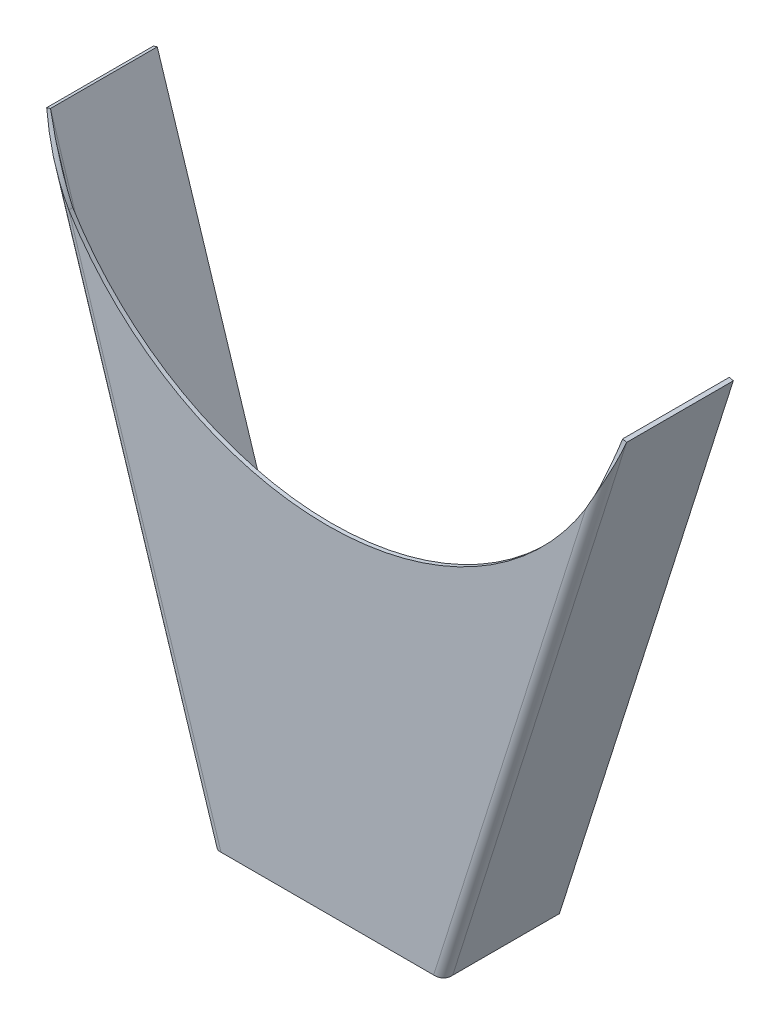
ISO-10303-21;
HEADER;
FILE_DESCRIPTION(('STEP AP214'),'2;1');
FILE_NAME('part.step','',(''),(''),'','','');
FILE_SCHEMA(('AUTOMOTIVE_DESIGN { 1 0 10303 214 1 1 1 1 }'));
ENDSEC;
DATA;
#1=APPLICATION_CONTEXT('core data for automotive mechanical design processes');
#2=APPLICATION_PROTOCOL_DEFINITION('international standard','automotive_design',2000,#1);
#3=PRODUCT_CONTEXT('',#1,'mechanical');
#4=PRODUCT('Part','Part','',(#3));
#5=PRODUCT_RELATED_PRODUCT_CATEGORY('part','',(#4));
#6=PRODUCT_DEFINITION_FORMATION('','',#4);
#7=PRODUCT_DEFINITION_CONTEXT('part definition',#1,'design');
#8=PRODUCT_DEFINITION('design','',#6,#7);
#9=PRODUCT_DEFINITION_SHAPE('','',#8);
#10=(LENGTH_UNIT() NAMED_UNIT(*) SI_UNIT(.MILLI.,.METRE.));
#11=(NAMED_UNIT(*) PLANE_ANGLE_UNIT() SI_UNIT($,.RADIAN.));
#12=(NAMED_UNIT(*) SI_UNIT($,.STERADIAN.) SOLID_ANGLE_UNIT());
#13=UNCERTAINTY_MEASURE_WITH_UNIT(LENGTH_MEASURE(1.E-05),#10,'distance_accuracy_value','');
#14=(GEOMETRIC_REPRESENTATION_CONTEXT(3) GLOBAL_UNCERTAINTY_ASSIGNED_CONTEXT((#13)) GLOBAL_UNIT_ASSIGNED_CONTEXT((#10,
#11,#12)) REPRESENTATION_CONTEXT('',''));
#15=CARTESIAN_POINT('',(0.,0.,0.));
#16=DIRECTION('',(0.,0.,1.));
#17=DIRECTION('',(1.,0.,0.));
#18=AXIS2_PLACEMENT_3D('',#15,#16,#17);
#19=CARTESIAN_POINT('',(0.,0.,2.5));
#20=DIRECTION('',(0.,0.,-1.));
#21=DIRECTION('',(-1.,0.,0.));
#22=AXIS2_PLACEMENT_3D('',#19,#20,#21);
#23=CYLINDRICAL_SURFACE('',#22,190.);
#24=CARTESIAN_POINT('',(0.,0.,2.5));
#25=DIRECTION('',(0.,0.,-1.));
#26=DIRECTION('',(1.,0.,0.));
#27=AXIS2_PLACEMENT_3D('',#24,#25,#26);
#28=CIRCLE('',#27,190.);
#29=CARTESIAN_POINT('',(161.506295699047,-100.078551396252,2.5));
#30=VERTEX_POINT('',#29);
#31=CARTESIAN_POINT('',(-161.506295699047,-100.078551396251,2.49999999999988));
#32=VERTEX_POINT('',#31);
#33=EDGE_CURVE('E13',#30,#32,#28,.T.);
#34=ORIENTED_EDGE('',*,*,#33,.F.);
#35=DIRECTION('',(0.,0.,1.));
#36=VECTOR('',#35,1.);
#37=CARTESIAN_POINT('',(161.506295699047,-100.07855139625,2.06014373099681E-13));
#38=LINE('',#37,#36);
#39=CARTESIAN_POINT('',(161.506295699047,-100.07855139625,2.06006392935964E-13));
#40=VERTEX_POINT('',#39);
#41=EDGE_CURVE('E221',#40,#30,#38,.T.);
#42=ORIENTED_EDGE('',*,*,#41,.F.);
#43=CARTESIAN_POINT('',(0.,0.,0.));
#44=DIRECTION('',(0.,0.,-1.));
#45=DIRECTION('',(-1.,0.,0.));
#46=AXIS2_PLACEMENT_3D('',#43,#44,#45);
#47=CIRCLE('',#46,190.);
#48=CARTESIAN_POINT('',(-161.506295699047,-100.078551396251,-1.16876994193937E-13));
#49=VERTEX_POINT('',#48);
#50=EDGE_CURVE('E79',#40,#49,#47,.T.);
#51=ORIENTED_EDGE('',*,*,#50,.T.);
#52=DIRECTION('',(0.,0.,1.));
#53=VECTOR('',#52,1.);
#54=CARTESIAN_POINT('',(-161.506295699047,-100.07855139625,-1.16993729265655E-13));
#55=LINE('',#54,#53);
#56=EDGE_CURVE('E361',#49,#32,#55,.T.);
#57=ORIENTED_EDGE('',*,*,#56,.T.);
#58=EDGE_LOOP('',(#34,#42,#51,#57));
#59=FACE_BOUND('',#58,.T.);
#60=ADVANCED_FACE('F76',(#59),#23,.F.);
#61=CARTESIAN_POINT('',(-72.4999999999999,-400.,2.5));
#62=DIRECTION('',(0.,-1.,0.));
#63=DIRECTION('',(1.,0.,0.));
#64=AXIS2_PLACEMENT_3D('',#61,#62,#63);
#65=PLANE('',#64);
#66=DIRECTION('',(1.,0.,0.));
#67=VECTOR('',#66,1.);
#68=CARTESIAN_POINT('',(0.,-400.,0.));
#69=LINE('',#68,#67);
#70=CARTESIAN_POINT('',(-66.4154647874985,-400.,-1.33949355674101E-13));
#71=VERTEX_POINT('',#70);
#72=CARTESIAN_POINT('',(66.4154647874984,-400.,2.23128807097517E-13));
#73=VERTEX_POINT('',#72);
#74=EDGE_CURVE('E355',#71,#73,#69,.T.);
#75=ORIENTED_EDGE('',*,*,#74,.T.);
#76=DIRECTION('',(0.,0.,1.));
#77=VECTOR('',#76,1.);
#78=CARTESIAN_POINT('',(66.4154647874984,-400.,2.2291196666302E-13));
#79=LINE('',#78,#77);
#80=CARTESIAN_POINT('',(66.4154647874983,-400.,2.50000000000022));
#81=VERTEX_POINT('',#80);
#82=EDGE_CURVE('E224',#73,#81,#79,.T.);
#83=ORIENTED_EDGE('',*,*,#82,.T.);
#84=DIRECTION('',(1.,0.,0.));
#85=VECTOR('',#84,1.);
#86=CARTESIAN_POINT('',(-72.4999999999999,-400.,2.5));
#87=LINE('',#86,#85);
#88=CARTESIAN_POINT('',(-66.4154647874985,-400.,2.5));
#89=VERTEX_POINT('',#88);
#90=EDGE_CURVE('E84',#89,#81,#87,.T.);
#91=ORIENTED_EDGE('',*,*,#90,.F.);
#92=DIRECTION('',(0.,0.,1.));
#93=VECTOR('',#92,1.);
#94=CARTESIAN_POINT('',(-66.4154647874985,-400.,-1.33891322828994E-13));
#95=LINE('',#94,#93);
#96=EDGE_CURVE('E357',#71,#89,#95,.T.);
#97=ORIENTED_EDGE('',*,*,#96,.F.);
#98=EDGE_LOOP('',(#75,#83,#91,#97));
#99=FACE_BOUND('',#98,.T.);
#100=ADVANCED_FACE('F417',(#99),#65,.T.);
#101=CARTESIAN_POINT('',(0.,0.,2.5));
#102=DIRECTION('',(0.,0.,1.));
#103=DIRECTION('',(1.,0.,0.));
#104=AXIS2_PLACEMENT_3D('',#101,#102,#103);
#105=PLANE('',#104);
#106=ORIENTED_EDGE('',*,*,#90,.T.);
#107=DIRECTION('',(-0.302225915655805,-0.953236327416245,0.));
#108=VECTOR('',#107,1.);
#109=CARTESIAN_POINT('',(66.4154647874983,-400.,2.50000000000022));
#110=LINE('',#109,#108);
#111=EDGE_CURVE('E170',#81,#30,#110,.F.);
#112=ORIENTED_EDGE('',*,*,#111,.T.);
#113=ORIENTED_EDGE('',*,*,#33,.T.);
#114=DIRECTION('',(-0.302225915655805,0.953236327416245,0.));
#115=VECTOR('',#114,1.);
#116=CARTESIAN_POINT('',(-175.586131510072,-55.6700136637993,2.49999999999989));
#117=LINE('',#116,#115);
#118=EDGE_CURVE('E321',#32,#89,#117,.F.);
#119=ORIENTED_EDGE('',*,*,#118,.T.);
#120=EDGE_LOOP('',(#106,#112,#113,#119));
#121=FACE_BOUND('',#120,.T.);
#122=ADVANCED_FACE('F338',(#121),#105,.T.);
#123=CARTESIAN_POINT('',(0.,0.,0.));
#124=DIRECTION('',(0.,0.,1.));
#125=DIRECTION('',(1.,0.,0.));
#126=AXIS2_PLACEMENT_3D('',#123,#124,#125);
#127=PLANE('',#126);
#128=DIRECTION('',(-0.302225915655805,-0.953236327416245,0.));
#129=VECTOR('',#128,1.);
#130=CARTESIAN_POINT('',(66.4154647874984,-400.,2.2291196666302E-13));
#131=LINE('',#130,#129);
#132=EDGE_CURVE('E218',#73,#40,#131,.F.);
#133=ORIENTED_EDGE('',*,*,#132,.F.);
#134=ORIENTED_EDGE('',*,*,#74,.F.);
#135=DIRECTION('',(-0.302225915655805,0.953236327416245,0.));
#136=VECTOR('',#135,1.);
#137=CARTESIAN_POINT('',(-175.586131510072,-55.6700136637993,-1.14491749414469E-13));
#138=LINE('',#137,#136);
#139=EDGE_CURVE('E353',#49,#71,#138,.F.);
#140=ORIENTED_EDGE('',*,*,#139,.F.);
#141=ORIENTED_EDGE('',*,*,#50,.F.);
#142=EDGE_LOOP('',(#133,#134,#140,#141));
#143=FACE_BOUND('',#142,.T.);
#144=ADVANCED_FACE('F414',(#143),#127,.F.);
#145=CARTESIAN_POINT('',(-66.4154647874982,-400.,2.52499999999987));
#146=CARTESIAN_POINT('',(-67.1887463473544,-400.084383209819,2.5249999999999));
#147=CARTESIAN_POINT('',(-67.9614739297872,-400.168646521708,2.37339084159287));
#148=CARTESIAN_POINT('',(-69.397115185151,-400.302300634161,1.78980571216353));
#149=CARTESIAN_POINT('',(-70.0593664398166,-400.351509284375,1.35805935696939));
#150=CARTESIAN_POINT('',(-71.1798921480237,-400.385255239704,0.279734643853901));
#151=CARTESIAN_POINT('',(-71.6377621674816,-400.369664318,-0.366419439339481));
#152=CARTESIAN_POINT('',(-72.2866841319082,-400.253887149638,-1.77531857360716));
#153=CARTESIAN_POINT('',(-72.4775091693,-400.153656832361,-2.53737713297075));
#154=CARTESIAN_POINT('',(-72.5238309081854,-400.007555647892,-3.29999999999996));
#155=CARTESIAN_POINT('',(-66.4154647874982,-400.,2.49999999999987));
#156=CARTESIAN_POINT('',(-67.1856262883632,-400.083394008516,2.4999999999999));
#157=CARTESIAN_POINT('',(-67.9552362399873,-400.166668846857,2.34904152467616));
#158=CARTESIAN_POINT('',(-69.3851134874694,-400.298495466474,1.76796105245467));
#159=CARTESIAN_POINT('',(-70.0447212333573,-400.346865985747,1.33806768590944));
#160=CARTESIAN_POINT('',(-71.1608353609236,-400.379213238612,0.264370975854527));
#161=CARTESIAN_POINT('',(-71.616939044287,-400.363062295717,-0.379009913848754));
#162=CARTESIAN_POINT('',(-72.2634734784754,-400.246528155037,-1.78186227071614));
#163=CARTESIAN_POINT('',(-72.4536782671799,-400.146101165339,-2.54065024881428));
#164=CARTESIAN_POINT('',(-72.5,-400.,-3.29999999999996));
#165=CARTESIAN_POINT('',(-66.4154647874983,-400.,-1.34007388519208E-13));
#166=CARTESIAN_POINT('',(-66.8736203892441,-399.984473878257,-1.15817381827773E-13));
#167=CARTESIAN_POINT('',(-67.3314672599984,-399.968901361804,-0.0858901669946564));
#168=CARTESIAN_POINT('',(-68.1849437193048,-399.917978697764,-0.416504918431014));
#169=CARTESIAN_POINT('',(-68.5802005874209,-399.882536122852,-0.661099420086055));
#170=CARTESIAN_POINT('',(-69.2551566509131,-399.775013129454,-1.2719958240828));
#171=CARTESIAN_POINT('',(-69.5346267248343,-399.702860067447,-1.63805736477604));
#172=CARTESIAN_POINT('',(-69.9424081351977,-399.510628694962,-2.43623198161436));
#173=CARTESIAN_POINT('',(-70.0705880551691,-399.390534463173,-2.86796183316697));
#174=CARTESIAN_POINT('',(-70.1169091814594,-399.244435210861,-3.29999999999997));
#175=CARTESIAN_POINT('',(-66.4154647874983,-400.,-0.025250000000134));
#176=CARTESIAN_POINT('',(-66.870469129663,-399.983474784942,-0.025250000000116));
#177=CARTESIAN_POINT('',(-67.3251671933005,-399.966903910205,-0.110482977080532));
#178=CARTESIAN_POINT('',(-68.1728220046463,-399.9141354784,-0.438568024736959));
#179=CARTESIAN_POINT('',(-68.5654089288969,-399.877846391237,-0.68129100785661));
#180=CARTESIAN_POINT('',(-69.235909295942,-399.768910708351,-1.28751312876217));
#181=CARTESIAN_POINT('',(-69.5135953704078,-399.696192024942,-1.65077374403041));
#182=CARTESIAN_POINT('',(-69.9189653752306,-399.503196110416,-2.44284111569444));
#183=CARTESIAN_POINT('',(-70.0465188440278,-399.382903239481,-2.87126768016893));
#184=CARTESIAN_POINT('',(-70.0928399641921,-399.23680400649,-3.29999999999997));
#185=B_SPLINE_SURFACE_WITH_KNOTS('',1,3,((#145,#146,#147,#148,#149,#150,#151,#152,#153,#154),
(#155,#156,#157,#158,#159,#160,#161,#162,#163,#164),(#165,#166,#167,#168,#169,#170,#171,#172,
#173,#174),(#175,#176,#177,#178,#179,#180,#181,#182,#183,#184)),.UNSPECIFIED.,.F.,.F.,.F.,(2,1,
1,2),(4,2,2,2,4),(-0.01,0.,1.,1.0101),(0.,0.25,0.5,0.75,1.),.UNSPECIFIED.);
#186=DIRECTION('',(-0.953236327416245,-0.302225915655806,0.));
#187=VECTOR('',#186,1.);
#188=CARTESIAN_POINT('',(-72.4999999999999,-400.,-3.29999999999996));
#189=LINE('',#188,#187);
#190=CARTESIAN_POINT('',(-70.1169091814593,-399.244435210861,-3.29999999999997));
#191=VERTEX_POINT('',#190);
#192=CARTESIAN_POINT('',(-72.4999999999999,-400.000000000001,-3.29999999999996));
#193=VERTEX_POINT('',#192);
#194=EDGE_CURVE('E223',#191,#193,#189,.T.);
#195=CARTESIAN_POINT('',(-66.4154647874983,-400.,-1.33573707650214E-13));
#196=CARTESIAN_POINT('',(-66.5237714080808,-399.996327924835,1.33250476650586E-05));
#197=CARTESIAN_POINT('',(-66.6320727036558,-399.992656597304,-0.00474118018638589));
#198=CARTESIAN_POINT('',(-66.8478346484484,-399.98505029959,-0.0236845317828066));
#199=CARTESIAN_POINT('',(-66.9552953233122,-399.981115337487,-0.0378730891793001));
#200=CARTESIAN_POINT('',(-67.1684306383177,-399.972721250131,-0.0755616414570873));
#201=CARTESIAN_POINT('',(-67.2741071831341,-399.968262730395,-0.0990509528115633));
#202=CARTESIAN_POINT('',(-67.4829494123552,-399.958558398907,-0.155113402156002));
#203=CARTESIAN_POINT('',(-67.5861152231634,-399.953312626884,-0.18768608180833));
#204=CARTESIAN_POINT('',(-67.8836989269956,-399.936413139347,-0.296119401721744));
#205=CARTESIAN_POINT('',(-68.073790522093,-399.923335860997,-0.384072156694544));
#206=CARTESIAN_POINT('',(-68.4361755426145,-399.891603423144,-0.590078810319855));
#207=CARTESIAN_POINT('',(-68.608474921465,-399.872950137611,-0.708122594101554));
#208=CARTESIAN_POINT('',(-68.9306198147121,-399.82852416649,-0.970535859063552));
#209=CARTESIAN_POINT('',(-69.0804674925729,-399.80275216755,-1.11490280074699));
#210=CARTESIAN_POINT('',(-69.353702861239,-399.7427569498,-1.42555212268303));
#211=CARTESIAN_POINT('',(-69.4770781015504,-399.708529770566,-1.59184475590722));
#212=CARTESIAN_POINT('',(-69.6396965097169,-399.650119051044,-1.85346922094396));
#213=CARTESIAN_POINT('',(-69.6901927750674,-399.629451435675,-1.94278337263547));
#214=CARTESIAN_POINT('',(-69.783407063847,-399.585653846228,-2.12479083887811));
#215=CARTESIAN_POINT('',(-69.8261279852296,-399.562524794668,-2.21748287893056));
#216=CARTESIAN_POINT('',(-69.9034903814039,-399.513748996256,-2.4054068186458));
#217=CARTESIAN_POINT('',(-69.9381402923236,-399.488104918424,-2.5006359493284));
#218=CARTESIAN_POINT('',(-69.9992197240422,-399.434225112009,-2.69293735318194));
#219=CARTESIAN_POINT('',(-70.0256530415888,-399.405990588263,-2.79000875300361));
#220=CARTESIAN_POINT('',(-70.0635313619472,-399.35571982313,-2.95604859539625));
#221=CARTESIAN_POINT('',(-70.077094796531,-399.334353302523,-3.02474486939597));
#222=CARTESIAN_POINT('',(-70.1000897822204,-399.290352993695,-3.16229196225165));
#223=CARTESIAN_POINT('',(-70.1095282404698,-399.267721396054,-3.23114232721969));
#224=CARTESIAN_POINT('',(-70.1169091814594,-399.244435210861,-3.29999999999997));
#225=B_SPLINE_CURVE_WITH_KNOTS('',3,(#195,#196,#197,#198,#199,#200,#201,#202,#203,#204,#205,
#206,#207,#208,#209,#210,#211,#212,#213,#214,#215,#216,#217,#218,#219,#220,#221,#222,#223,#224),
.UNSPECIFIED.,.F.,.F.,(4,2,2,2,2,2,2,2,2,2,2,2,2,2,4),(0.,0.324992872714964,0.649975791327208,
0.974586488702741,1.2991808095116,1.92552725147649,2.55166342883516,3.17773923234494,
3.80410884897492,4.11778762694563,4.43134925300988,4.74458164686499,5.05766908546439,
5.27717818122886,5.49631829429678),.UNSPECIFIED.);
#226=EDGE_CURVE('E322',#71,#191,#225,.T.);
#227=CARTESIAN_POINT('',(-66.4154647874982,-400.,2.49999999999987));
#228=CARTESIAN_POINT('',(-66.5842647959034,-400.01827653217,2.50001899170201));
#229=CARTESIAN_POINT('',(-66.7530620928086,-400.036552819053,2.49283728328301));
#230=CARTESIAN_POINT('',(-67.0894746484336,-400.072733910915,2.46420961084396));
#231=CARTESIAN_POINT('',(-67.2570899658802,-400.090638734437,2.44276436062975));
#232=CARTESIAN_POINT('',(-67.5898510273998,-400.125694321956,2.38576865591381));
#233=CARTESIAN_POINT('',(-67.7549985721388,-400.142845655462,2.35022906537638));
#234=CARTESIAN_POINT('',(-68.0818088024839,-400.176040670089,2.26531400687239));
#235=CARTESIAN_POINT('',(-68.2434715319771,-400.192084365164,2.21593871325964));
#236=CARTESIAN_POINT('',(-68.5622584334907,-400.222718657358,2.10369254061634));
#237=CARTESIAN_POINT('',(-68.7193807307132,-400.237308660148,2.04081617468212));
#238=CARTESIAN_POINT('',(-69.0279875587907,-400.264687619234,1.90201989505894));
#239=CARTESIAN_POINT('',(-69.1794699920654,-400.277475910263,1.82609518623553));
#240=CARTESIAN_POINT('',(-69.4756300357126,-400.300912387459,1.6618125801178));
#241=CARTESIAN_POINT('',(-69.6203103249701,-400.311561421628,1.57345963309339));
#242=CARTESIAN_POINT('',(-69.901938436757,-400.330406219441,1.38494991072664));
#243=CARTESIAN_POINT('',(-70.038886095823,-400.338601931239,1.28479288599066));
#244=CARTESIAN_POINT('',(-70.3041022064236,-400.352240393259,1.07342227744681));
#245=CARTESIAN_POINT('',(-70.4323710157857,-400.357683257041,0.962209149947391));
#246=CARTESIAN_POINT('',(-70.6793612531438,-400.365542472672,0.729545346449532));
#247=CARTESIAN_POINT('',(-70.7980826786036,-400.367958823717,0.608094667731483));
#248=CARTESIAN_POINT('',(-71.0252058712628,-400.369511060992,0.355819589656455));
#249=CARTESIAN_POINT('',(-71.1336047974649,-400.368646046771,0.224992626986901));
#250=CARTESIAN_POINT('',(-71.339316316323,-400.363404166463,-0.0450343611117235));
#251=CARTESIAN_POINT('',(-71.4366291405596,-400.359027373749,-0.184234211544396));
#252=CARTESIAN_POINT('',(-71.6195700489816,-400.346549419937,-0.470045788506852));
#253=CARTESIAN_POINT('',(-71.7051925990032,-400.33844650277,-0.616660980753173));
#254=CARTESIAN_POINT('',(-71.8641099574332,-400.318344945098,-0.916101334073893));
#255=CARTESIAN_POINT('',(-71.9374092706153,-400.306347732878,-1.06892420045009));
#256=CARTESIAN_POINT('',(-72.071218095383,-400.278314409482,-1.37962511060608));
#257=CARTESIAN_POINT('',(-72.1317337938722,-400.262280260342,-1.53750066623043));
#258=CARTESIAN_POINT('',(-72.239631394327,-400.226063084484,-1.85715425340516));
#259=CARTESIAN_POINT('',(-72.287017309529,-400.205881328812,-2.01893107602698));
#260=CARTESIAN_POINT('',(-72.373626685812,-400.158403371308,-2.3662178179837));
#261=CARTESIAN_POINT('',(-72.411020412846,-400.13052636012,-2.55210753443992));
#262=CARTESIAN_POINT('',(-72.468494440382,-400.069347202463,-2.92533605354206));
#263=CARTESIAN_POINT('',(-72.4886034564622,-400.036054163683,-3.1126719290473));
#264=CARTESIAN_POINT('',(-72.5,-400.,-3.29999999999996));
#265=B_SPLINE_CURVE_WITH_KNOTS('',3,(#227,#228,#229,#230,#231,#232,#233,#234,#235,#236,#237,
#238,#239,#240,#241,#242,#243,#244,#245,#246,#247,#248,#249,#250,#251,#252,#253,#254,#255,#256,
#257,#258,#259,#260,#261,#262,#263,#264),.UNSPECIFIED.,.F.,.F.,(4,2,2,2,2,2,2,2,2,2,2,2,2,2,2,2,
2,2,4),(0.,0.509204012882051,1.01838254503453,1.52716936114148,2.03594976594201,
2.54493733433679,3.05411235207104,3.56308513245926,4.07206866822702,4.58103120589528,
5.08999387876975,5.59909622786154,6.10818794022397,6.61751982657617,7.12666511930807,
7.63556343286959,8.14430602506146,8.7183822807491,9.29150295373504),.UNSPECIFIED.);
#266=EDGE_CURVE('E100',#89,#193,#265,.T.);
#267=ORIENTED_EDGE('',*,*,#194,.F.);
#268=ORIENTED_EDGE('',*,*,#226,.F.);
#269=ORIENTED_EDGE('',*,*,#96,.T.);
#270=ORIENTED_EDGE('',*,*,#266,.T.);
#271=EDGE_LOOP('',(#267,#268,#269,#270));
#272=FACE_BOUND('',#271,.T.);
#273=ADVANCED_FACE('F333',(#272),#185,.F.);
#274=CARTESIAN_POINT('',(-181.138733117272,-57.4304796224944,-3.29999999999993));
#275=CARTESIAN_POINT('',(-179.965405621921,-61.1312158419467,-2.53750419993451));
#276=CARTESIAN_POINT('',(-178.647574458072,-64.7860823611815,-1.77531857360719));
#277=CARTESIAN_POINT('',(-175.744640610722,-72.0111307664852,-0.366419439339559));
#278=CARTESIAN_POINT('',(-174.159764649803,-75.5813573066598,0.279734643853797));
#279=CARTESIAN_POINT('',(-170.785227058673,-82.6568825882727,1.35805935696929));
#280=CARTESIAN_POINT('',(-168.995969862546,-86.1623095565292,1.78980571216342));
#281=CARTESIAN_POINT('',(-165.306316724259,-93.137926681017,2.37339084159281));
#282=CARTESIAN_POINT('',(-163.406461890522,-96.6082611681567,2.52499999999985));
#283=CARTESIAN_POINT('',(-161.506295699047,-100.078551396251,2.52499999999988));
#284=CARTESIAN_POINT('',(-181.114902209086,-57.422923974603,-3.29999999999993));
#285=CARTESIAN_POINT('',(-179.941574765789,-61.1236600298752,-2.54077673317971));
#286=CARTESIAN_POINT('',(-178.624363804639,-64.7787233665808,-1.78186227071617));
#287=CARTESIAN_POINT('',(-175.723817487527,-72.0045287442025,-0.379009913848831));
#288=CARTESIAN_POINT('',(-174.140707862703,-75.5753153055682,0.264370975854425));
#289=CARTESIAN_POINT('',(-170.770581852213,-82.6522392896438,1.33806768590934));
#290=CARTESIAN_POINT('',(-168.983968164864,-86.158504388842,1.76796105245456));
#291=CARTESIAN_POINT('',(-165.300079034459,-93.1359490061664,2.3490415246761));
#292=CARTESIAN_POINT('',(-163.403342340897,-96.6072722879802,2.49999999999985));
#293=CARTESIAN_POINT('',(-161.506295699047,-100.078551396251,2.49999999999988));
#294=CARTESIAN_POINT('',(-178.731811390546,-56.6673591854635,-3.29999999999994));
#295=CARTESIAN_POINT('',(-177.55848915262,-60.3680788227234,-2.86803005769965));
#296=CARTESIAN_POINT('',(-176.303298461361,-64.0428239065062,-2.43623198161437));
#297=CARTESIAN_POINT('',(-173.641505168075,-71.3443265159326,-1.63805736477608));
#298=CARTESIAN_POINT('',(-172.235029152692,-74.9711151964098,-1.27199582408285));
#299=CARTESIAN_POINT('',(-169.306061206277,-82.1879094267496,-0.661099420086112));
#300=CARTESIAN_POINT('',(-167.783798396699,-85.7779876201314,-0.416504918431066));
#301=CARTESIAN_POINT('',(-164.67631005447,-92.9381815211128,-0.0858901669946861));
#302=CARTESIAN_POINT('',(-163.091387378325,-96.5083842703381,-1.25946744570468E-13));
#303=CARTESIAN_POINT('',(-161.506295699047,-100.078551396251,-1.17093834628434E-13));
#304=CARTESIAN_POINT('',(-178.707742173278,-56.6597279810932,-3.29999999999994));
#305=CARTESIAN_POINT('',(-177.534419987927,-60.3604474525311,-2.8713353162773));
#306=CARTESIAN_POINT('',(-176.279855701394,-64.0353913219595,-2.44284111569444));
#307=CARTESIAN_POINT('',(-173.620473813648,-71.3376584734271,-1.65077374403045));
#308=CARTESIAN_POINT('',(-172.215781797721,-74.9650127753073,-1.28751312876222));
#309=CARTESIAN_POINT('',(-169.291269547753,-82.1832196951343,-0.681291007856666));
#310=CARTESIAN_POINT('',(-167.771676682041,-85.7741444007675,-0.438568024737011));
#311=CARTESIAN_POINT('',(-164.670009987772,-92.9361840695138,-0.110482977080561));
#312=CARTESIAN_POINT('',(-163.088236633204,-96.5073855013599,-0.0252500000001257));
#313=CARTESIAN_POINT('',(-161.506295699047,-100.078551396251,-0.0252500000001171));
#314=B_SPLINE_SURFACE_WITH_KNOTS('',1,3,((#274,#275,#276,#277,#278,#279,#280,#281,#282,#283),
(#284,#285,#286,#287,#288,#289,#290,#291,#292,#293),(#294,#295,#296,#297,#298,#299,#300,#301,
#302,#303),(#304,#305,#306,#307,#308,#309,#310,#311,#312,#313)),.UNSPECIFIED.,.F.,.F.,.F.,(2,1,
1,2),(4,2,2,2,4),(-0.01,0.,1.,1.0101),(0.,0.25,0.5,0.75,1.),.UNSPECIFIED.);
#315=CARTESIAN_POINT('',(-178.731811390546,-56.6673591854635,-3.29999999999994));
#316=CARTESIAN_POINT('',(-178.476837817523,-57.4715916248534,-3.20613002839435));
#317=CARTESIAN_POINT('',(-178.21802826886,-58.2746057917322,-3.11225905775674));
#318=CARTESIAN_POINT('',(-177.692799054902,-59.8782404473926,-2.92519330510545));
#319=CARTESIAN_POINT('',(-177.42637922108,-60.6788608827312,-2.83199853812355));
#320=CARTESIAN_POINT('',(-176.795664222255,-62.5450064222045,-2.61603474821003));
#321=CARTESIAN_POINT('',(-176.42842775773,-63.6096002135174,-2.49379591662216));
#322=CARTESIAN_POINT('',(-175.680882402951,-65.7346766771,-2.25333624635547));
#323=CARTESIAN_POINT('',(-175.300573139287,-66.7951592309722,-2.13511552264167));
#324=CARTESIAN_POINT('',(-174.52740662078,-68.9121554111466,-1.90421327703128));
#325=CARTESIAN_POINT('',(-174.134549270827,-69.9686690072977,-1.79153179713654));
#326=CARTESIAN_POINT('',(-173.336909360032,-72.0780700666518,-1.57314288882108));
#327=CARTESIAN_POINT('',(-172.932125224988,-73.1309570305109,-1.46743638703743));
#328=CARTESIAN_POINT('',(-172.111531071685,-75.2332281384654,-1.26440572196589));
#329=CARTESIAN_POINT('',(-171.695721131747,-76.2826123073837,-1.16708149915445));
#330=CARTESIAN_POINT('',(-170.854051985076,-78.3781906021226,-0.982068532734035));
#331=CARTESIAN_POINT('',(-170.428192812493,-79.4243847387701,-0.89437975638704));
#332=CARTESIAN_POINT('',(-169.546499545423,-81.5649748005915,-0.725745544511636));
#333=CARTESIAN_POINT('',(-169.09021744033,-82.6592287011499,-0.645338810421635));
#334=CARTESIAN_POINT('',(-168.169221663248,-84.845069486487,-0.497519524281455));
#335=CARTESIAN_POINT('',(-167.704507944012,-85.9366563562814,-0.43010704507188));
#336=CARTESIAN_POINT('',(-166.768198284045,-88.1176553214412,-0.309243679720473));
#337=CARTESIAN_POINT('',(-166.29660231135,-89.2070674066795,-0.255792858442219));
#338=CARTESIAN_POINT('',(-165.3481140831,-91.3843120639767,-0.163599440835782));
#339=CARTESIAN_POINT('',(-164.871221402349,-92.4721445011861,-0.12485803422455));
#340=CARTESIAN_POINT('',(-163.913878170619,-94.646682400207,-0.0626565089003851));
#341=CARTESIAN_POINT('',(-163.433427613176,-95.7333878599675,-0.0391964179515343));
#342=CARTESIAN_POINT('',(-162.470748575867,-97.9062450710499,-0.00784728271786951));
#343=CARTESIAN_POINT('',(-161.988520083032,-98.992396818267,4.16477613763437E-05));
#344=CARTESIAN_POINT('',(-161.506295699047,-100.078551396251,-1.17093834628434E-13));
#345=B_SPLINE_CURVE_WITH_KNOTS('',3,(#315,#316,#317,#318,#319,#320,#321,#322,#323,#324,#325,
#326,#327,#328,#329,#330,#331,#332,#333,#334,#335,#336,#337,#338,#339,#340,#341,#342,#343,#344),
.UNSPECIFIED.,.F.,.F.,(4,2,2,2,2,2,2,2,2,2,2,2,2,2,4),(0.,2.5466545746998,5.09336558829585,
8.49157783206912,11.8898872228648,15.2882223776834,18.6870081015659,22.0857696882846,
25.4845197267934,29.0493065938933,32.614113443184,36.1789368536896,39.7440485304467,
43.3091666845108,46.8743108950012),.UNSPECIFIED.);
#346=CARTESIAN_POINT('',(-178.731811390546,-56.6673591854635,-3.29999999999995));
#347=VERTEX_POINT('',#346);
#348=EDGE_CURVE('E346',#347,#49,#345,.T.);
#349=DIRECTION('',(-0.953236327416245,-0.302225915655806,0.));
#350=VECTOR('',#349,1.);
#351=CARTESIAN_POINT('',(-178.731811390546,-56.6673591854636,-3.29999999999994));
#352=LINE('',#351,#350);
#353=CARTESIAN_POINT('',(-181.114902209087,-57.4229239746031,-3.29999999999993));
#354=VERTEX_POINT('',#353);
#355=EDGE_CURVE('E374',#347,#354,#352,.T.);
#356=CARTESIAN_POINT('',(-181.114902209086,-57.422923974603,-3.29999999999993));
#357=CARTESIAN_POINT('',(-180.865598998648,-58.2092907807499,-3.13868132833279));
#358=CARTESIAN_POINT('',(-180.609852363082,-58.9936089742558,-2.97736229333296));
#359=CARTESIAN_POINT('',(-180.085563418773,-60.5582390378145,-2.65582920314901));
#360=CARTESIAN_POINT('',(-179.817020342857,-61.338550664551,-2.49561521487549));
#361=CARTESIAN_POINT('',(-179.174822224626,-63.1568949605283,-2.12391542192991));
#362=CARTESIAN_POINT('',(-178.796188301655,-64.1933524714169,-1.91330574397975));
#363=CARTESIAN_POINT('',(-178.016836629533,-66.2593609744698,-1.4987059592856));
#364=CARTESIAN_POINT('',(-177.616117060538,-67.2889113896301,-1.29471640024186));
#365=CARTESIAN_POINT('',(-176.793449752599,-69.3413075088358,-0.895880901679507));
#366=CARTESIAN_POINT('',(-176.371501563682,-70.3641530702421,-0.701035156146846));
#367=CARTESIAN_POINT('',(-175.507303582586,-72.4038625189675,-0.322820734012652));
#368=CARTESIAN_POINT('',(-175.065045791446,-73.4207238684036,-0.139456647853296));
#369=CARTESIAN_POINT('',(-174.161761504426,-75.4484749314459,0.213396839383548));
#370=CARTESIAN_POINT('',(-173.700735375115,-76.4593647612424,0.382886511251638));
#371=CARTESIAN_POINT('',(-172.761496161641,-78.4756938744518,0.705891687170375));
#372=CARTESIAN_POINT('',(-172.283283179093,-79.4811331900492,0.85940728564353));
#373=CARTESIAN_POINT('',(-171.39749728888,-81.3095476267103,1.12297182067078));
#374=CARTESIAN_POINT('',(-170.992407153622,-82.1333122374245,1.23590441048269));
#375=CARTESIAN_POINT('',(-170.172887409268,-83.777897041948,1.44872769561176));
#376=CARTESIAN_POINT('',(-169.758457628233,-84.5987171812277,1.54861815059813));
#377=CARTESIAN_POINT('',(-168.921461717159,-86.2377944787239,1.7344964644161));
#378=CARTESIAN_POINT('',(-168.498895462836,-87.0560515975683,1.82048411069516));
#379=CARTESIAN_POINT('',(-167.646870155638,-88.6903930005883,1.97783929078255));
#380=CARTESIAN_POINT('',(-167.217411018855,-89.5064772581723,2.04920664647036));
#381=CARTESIAN_POINT('',(-166.352778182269,-91.13712751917,2.17673918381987));
#382=CARTESIAN_POINT('',(-165.917602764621,-91.9516929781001,2.2328996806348));
#383=CARTESIAN_POINT('',(-165.043004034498,-93.5794734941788,2.32952227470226));
#384=CARTESIAN_POINT('',(-164.603580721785,-94.3926885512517,2.36998437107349));
#385=CARTESIAN_POINT('',(-163.721892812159,-96.0182277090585,2.43485401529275));
#386=CARTESIAN_POINT('',(-163.279628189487,-96.8305518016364,2.45926141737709));
#387=CARTESIAN_POINT('',(-162.393673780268,-98.4547671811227,2.49184686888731));
#388=CARTESIAN_POINT('',(-161.94998396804,-99.2666584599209,2.50002462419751));
#389=CARTESIAN_POINT('',(-161.506295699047,-100.078551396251,2.49999999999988));
#390=B_SPLINE_CURVE_WITH_KNOTS('',3,(#356,#357,#358,#359,#360,#361,#362,#363,#364,#365,#366,
#367,#368,#369,#370,#371,#372,#373,#374,#375,#376,#377,#378,#379,#380,#381,#382,#383,#384,#385,
#386,#387,#388,#389),.UNSPECIFIED.,.F.,.F.,(4,2,2,2,2,2,2,2,2,2,2,2,2,2,2,2,4),(0.,
2.5216559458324,5.04346326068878,8.41331002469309,11.783434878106,15.1536311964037,
18.525166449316,21.8966358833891,25.268085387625,28.0426471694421,30.8172600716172,
33.5919153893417,36.3666045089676,39.1421474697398,41.9176905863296,44.6932589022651,
47.4688775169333),.UNSPECIFIED.);
#391=EDGE_CURVE('E313',#354,#32,#390,.T.);
#392=ORIENTED_EDGE('',*,*,#348,.F.);
#393=ORIENTED_EDGE('',*,*,#355,.T.);
#394=ORIENTED_EDGE('',*,*,#391,.T.);
#395=ORIENTED_EDGE('',*,*,#56,.F.);
#396=EDGE_LOOP('',(#392,#393,#394,#395));
#397=FACE_BOUND('',#396,.T.);
#398=ADVANCED_FACE('F302',(#397),#314,.F.);
#399=CARTESIAN_POINT('',(-175.586131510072,-55.6700136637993,-3.29999999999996));
#400=DIRECTION('',(-0.302225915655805,0.953236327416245,0.));
#401=DIRECTION('',(-0.953236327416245,-0.302225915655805,0.));
#402=AXIS2_PLACEMENT_3D('',#399,#400,#401);
#403=CYLINDRICAL_SURFACE('',#402,5.79999999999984);
#404=ORIENTED_EDGE('',*,*,#118,.F.);
#405=ORIENTED_EDGE('',*,*,#391,.F.);
#406=DIRECTION('',(-0.302225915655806,0.953236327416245,0.));
#407=VECTOR('',#406,1.);
#408=CARTESIAN_POINT('',(-181.114902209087,-57.4229239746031,-3.29999999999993));
#409=LINE('',#408,#407);
#410=EDGE_CURVE('E377',#193,#354,#409,.T.);
#411=ORIENTED_EDGE('',*,*,#410,.F.);
#412=ORIENTED_EDGE('',*,*,#266,.F.);
#413=EDGE_LOOP('',(#404,#405,#411,#412));
#414=FACE_BOUND('',#413,.T.);
#415=ADVANCED_FACE('F298',(#414),#403,.T.);
#416=CARTESIAN_POINT('',(-175.586131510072,-55.6700136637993,-3.29999999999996));
#417=DIRECTION('',(-0.302225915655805,0.953236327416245,0.));
#418=DIRECTION('',(-0.953236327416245,-0.302225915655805,0.));
#419=AXIS2_PLACEMENT_3D('',#416,#417,#418);
#420=CYLINDRICAL_SURFACE('',#419,3.29999999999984);
#421=ORIENTED_EDGE('',*,*,#139,.T.);
#422=ORIENTED_EDGE('',*,*,#226,.T.);
#423=DIRECTION('',(0.302225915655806,-0.953236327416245,0.));
#424=VECTOR('',#423,1.);
#425=CARTESIAN_POINT('',(-70.1169091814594,-399.244435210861,-3.29999999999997));
#426=LINE('',#425,#424);
#427=EDGE_CURVE('E372',#191,#347,#426,.F.);
#428=ORIENTED_EDGE('',*,*,#427,.T.);
#429=ORIENTED_EDGE('',*,*,#348,.T.);
#430=EDGE_LOOP('',(#421,#422,#428,#429));
#431=FACE_BOUND('',#430,.T.);
#432=ADVANCED_FACE('F290',(#431),#420,.F.);
#433=CARTESIAN_POINT('',(-181.114902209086,-57.4229239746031,0.));
#434=DIRECTION('',(-0.302225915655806,0.953236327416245,0.));
#435=DIRECTION('',(-0.953236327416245,-0.302225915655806,0.));
#436=AXIS2_PLACEMENT_3D('',#433,#434,#435);
#437=PLANE('',#436);
#438=DIRECTION('',(0.,0.,1.));
#439=VECTOR('',#438,1.);
#440=CARTESIAN_POINT('',(-181.114902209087,-57.4229239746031,0.));
#441=LINE('',#440,#439);
#442=CARTESIAN_POINT('',(-181.114902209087,-57.4229239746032,-70.));
#443=VERTEX_POINT('',#442);
#444=EDGE_CURVE('E393',#443,#354,#441,.T.);
#445=ORIENTED_EDGE('',*,*,#444,.T.);
#446=ORIENTED_EDGE('',*,*,#355,.F.);
#447=DIRECTION('',(0.,0.,-1.));
#448=VECTOR('',#447,1.);
#449=CARTESIAN_POINT('',(-178.731811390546,-56.6673591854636,7.08935751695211E-13));
#450=LINE('',#449,#448);
#451=CARTESIAN_POINT('',(-178.731811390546,-56.6673591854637,-70.));
#452=VERTEX_POINT('',#451);
#453=EDGE_CURVE('E385',#452,#347,#450,.F.);
#454=ORIENTED_EDGE('',*,*,#453,.F.);
#455=DIRECTION('',(0.953236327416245,0.302225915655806,0.));
#456=VECTOR('',#455,1.);
#457=CARTESIAN_POINT('',(-181.114902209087,-57.4229239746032,-70.));
#458=LINE('',#457,#456);
#459=EDGE_CURVE('E264',#443,#452,#458,.T.);
#460=ORIENTED_EDGE('',*,*,#459,.F.);
#461=EDGE_LOOP('',(#445,#446,#454,#460));
#462=FACE_BOUND('',#461,.T.);
#463=ADVANCED_FACE('F287',(#462),#437,.T.);
#464=CARTESIAN_POINT('',(-72.5000000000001,-400.,-70.));
#465=DIRECTION('',(0.302225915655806,-0.953236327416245,0.));
#466=DIRECTION('',(0.953236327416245,0.302225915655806,0.));
#467=AXIS2_PLACEMENT_3D('',#464,#465,#466);
#468=PLANE('',#467);
#469=DIRECTION('',(0.,0.,1.));
#470=VECTOR('',#469,1.);
#471=CARTESIAN_POINT('',(-70.1169091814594,-399.244435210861,9.29273998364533E-13));
#472=LINE('',#471,#470);
#473=CARTESIAN_POINT('',(-70.1169091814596,-399.244435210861,-70.));
#474=VERTEX_POINT('',#473);
#475=EDGE_CURVE('E380',#191,#474,#472,.F.);
#476=ORIENTED_EDGE('',*,*,#475,.F.);
#477=ORIENTED_EDGE('',*,*,#194,.T.);
#478=DIRECTION('',(0.,0.,-1.));
#479=VECTOR('',#478,1.);
#480=CARTESIAN_POINT('',(-72.5000000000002,-400.,-70.));
#481=LINE('',#480,#479);
#482=CARTESIAN_POINT('',(-72.5000000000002,-400.,-70.));
#483=VERTEX_POINT('',#482);
#484=EDGE_CURVE('E388',#193,#483,#481,.T.);
#485=ORIENTED_EDGE('',*,*,#484,.T.);
#486=DIRECTION('',(0.953236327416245,0.302225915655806,0.));
#487=VECTOR('',#486,1.);
#488=CARTESIAN_POINT('',(-72.5000000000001,-400.,-70.));
#489=LINE('',#488,#487);
#490=EDGE_CURVE('E395',#483,#474,#489,.T.);
#491=ORIENTED_EDGE('',*,*,#490,.T.);
#492=EDGE_LOOP('',(#476,#477,#485,#491));
#493=FACE_BOUND('',#492,.T.);
#494=ADVANCED_FACE('F281',(#493),#468,.T.);
#495=CARTESIAN_POINT('',(-181.114902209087,-57.4229239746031,7.17664455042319E-13));
#496=DIRECTION('',(-0.953236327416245,-0.302225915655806,0.));
#497=DIRECTION('',(0.302225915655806,-0.953236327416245,0.));
#498=AXIS2_PLACEMENT_3D('',#495,#496,#497);
#499=PLANE('',#498);
#500=ORIENTED_EDGE('',*,*,#484,.F.);
#501=ORIENTED_EDGE('',*,*,#410,.T.);
#502=ORIENTED_EDGE('',*,*,#444,.F.);
#503=DIRECTION('',(-0.302225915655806,0.953236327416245,0.));
#504=VECTOR('',#503,1.);
#505=CARTESIAN_POINT('',(-181.114902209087,-57.4229239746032,-70.));
#506=LINE('',#505,#504);
#507=EDGE_CURVE('E390',#483,#443,#506,.T.);
#508=ORIENTED_EDGE('',*,*,#507,.F.);
#509=EDGE_LOOP('',(#500,#501,#502,#508));
#510=FACE_BOUND('',#509,.T.);
#511=ADVANCED_FACE('F271',(#510),#499,.T.);
#512=CARTESIAN_POINT('',(-178.731811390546,-56.6673591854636,7.08935751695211E-13));
#513=DIRECTION('',(-0.953236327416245,-0.302225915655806,0.));
#514=DIRECTION('',(0.302225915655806,-0.953236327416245,0.));
#515=AXIS2_PLACEMENT_3D('',#512,#513,#514);
#516=PLANE('',#515);
#517=ORIENTED_EDGE('',*,*,#427,.F.);
#518=ORIENTED_EDGE('',*,*,#475,.T.);
#519=DIRECTION('',(0.302225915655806,-0.953236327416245,0.));
#520=VECTOR('',#519,1.);
#521=CARTESIAN_POINT('',(-178.731811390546,-56.6673591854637,-70.));
#522=LINE('',#521,#520);
#523=EDGE_CURVE('E382',#474,#452,#522,.F.);
#524=ORIENTED_EDGE('',*,*,#523,.T.);
#525=ORIENTED_EDGE('',*,*,#453,.T.);
#526=EDGE_LOOP('',(#517,#518,#524,#525));
#527=FACE_BOUND('',#526,.T.);
#528=ADVANCED_FACE('F280',(#527),#516,.F.);
#529=CARTESIAN_POINT('',(-181.114902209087,-57.4229239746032,-70.));
#530=DIRECTION('',(0.,0.,-1.));
#531=DIRECTION('',(-1.,0.,0.));
#532=AXIS2_PLACEMENT_3D('',#529,#530,#531);
#533=PLANE('',#532);
#534=ORIENTED_EDGE('',*,*,#523,.F.);
#535=ORIENTED_EDGE('',*,*,#490,.F.);
#536=ORIENTED_EDGE('',*,*,#507,.T.);
#537=ORIENTED_EDGE('',*,*,#459,.T.);
#538=EDGE_LOOP('',(#534,#535,#536,#537));
#539=FACE_BOUND('',#538,.T.);
#540=ADVANCED_FACE('F285',(#539),#533,.T.);
#541=CARTESIAN_POINT('',(161.506295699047,-100.07855139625,2.52500000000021));
#542=CARTESIAN_POINT('',(163.406461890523,-96.6082611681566,2.52500000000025));
#543=CARTESIAN_POINT('',(165.306316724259,-93.1379266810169,2.37339084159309));
#544=CARTESIAN_POINT('',(168.995969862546,-86.1623095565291,1.78980571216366));
#545=CARTESIAN_POINT('',(170.785227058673,-82.6568825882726,1.35805935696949));
#546=CARTESIAN_POINT('',(174.159764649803,-75.5813573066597,0.279734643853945));
#547=CARTESIAN_POINT('',(175.744640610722,-72.0111307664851,-0.366419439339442));
#548=CARTESIAN_POINT('',(178.647574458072,-64.7860823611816,-1.77531857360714));
#549=CARTESIAN_POINT('',(179.965405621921,-61.1312158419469,-2.53750419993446));
#550=CARTESIAN_POINT('',(181.138733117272,-57.4304796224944,-3.29999999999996));
#551=CARTESIAN_POINT('',(161.506295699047,-100.07855139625,2.50000000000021));
#552=CARTESIAN_POINT('',(163.403342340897,-96.6072722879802,2.50000000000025));
#553=CARTESIAN_POINT('',(165.300079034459,-93.1359490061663,2.34904152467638));
#554=CARTESIAN_POINT('',(168.983968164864,-86.158504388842,1.7679610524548));
#555=CARTESIAN_POINT('',(170.770581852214,-82.6522392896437,1.33806768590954));
#556=CARTESIAN_POINT('',(174.140707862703,-75.5753153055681,0.264370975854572));
#557=CARTESIAN_POINT('',(175.723817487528,-72.0045287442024,-0.379009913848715));
#558=CARTESIAN_POINT('',(178.624363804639,-64.7787233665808,-1.78186227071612));
#559=CARTESIAN_POINT('',(179.94157476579,-61.1236600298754,-2.54077673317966));
#560=CARTESIAN_POINT('',(181.114902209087,-57.422923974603,-3.29999999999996));
#561=CARTESIAN_POINT('',(161.506295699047,-100.07855139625,2.05998412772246E-13));
#562=CARTESIAN_POINT('',(163.091387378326,-96.5083842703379,1.89414301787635E-13));
#563=CARTESIAN_POINT('',(164.67631005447,-92.9381815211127,-0.0858901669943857));
#564=CARTESIAN_POINT('',(167.7837983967,-85.7779876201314,-0.416504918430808));
#565=CARTESIAN_POINT('',(169.306061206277,-82.1879094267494,-0.661099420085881));
#566=CARTESIAN_POINT('',(172.235029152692,-74.9711151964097,-1.27199582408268));
#567=CARTESIAN_POINT('',(173.641505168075,-71.3443265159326,-1.63805736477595));
#568=CARTESIAN_POINT('',(176.303298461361,-64.0428239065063,-2.43623198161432));
#569=CARTESIAN_POINT('',(177.55848915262,-60.3680788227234,-2.86803005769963));
#570=CARTESIAN_POINT('',(178.731811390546,-56.6673591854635,-3.29999999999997));
#571=CARTESIAN_POINT('',(161.506295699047,-100.07855139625,-0.025249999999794));
#572=CARTESIAN_POINT('',(163.088236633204,-96.5073855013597,-0.0252499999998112));
#573=CARTESIAN_POINT('',(164.670009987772,-92.9361840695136,-0.11048297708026));
#574=CARTESIAN_POINT('',(167.771676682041,-85.7741444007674,-0.438568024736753));
#575=CARTESIAN_POINT('',(169.291269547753,-82.1832196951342,-0.681291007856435));
#576=CARTESIAN_POINT('',(172.215781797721,-74.9650127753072,-1.28751312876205));
#577=CARTESIAN_POINT('',(173.620473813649,-71.3376584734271,-1.65077374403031));
#578=CARTESIAN_POINT('',(176.279855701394,-64.0353913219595,-2.44284111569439));
#579=CARTESIAN_POINT('',(177.534419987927,-60.3604474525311,-2.87133531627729));
#580=CARTESIAN_POINT('',(178.707742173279,-56.6597279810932,-3.29999999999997));
#581=B_SPLINE_SURFACE_WITH_KNOTS('',1,3,((#541,#542,#543,#544,#545,#546,#547,#548,#549,#550),
(#551,#552,#553,#554,#555,#556,#557,#558,#559,#560),(#561,#562,#563,#564,#565,#566,#567,#568,
#569,#570),(#571,#572,#573,#574,#575,#576,#577,#578,#579,#580)),.UNSPECIFIED.,.F.,.F.,.F.,(2,1,
1,2),(4,2,2,2,4),(-0.01,0.,1.,1.0101),(0.,0.25,0.5,0.75,1.),.UNSPECIFIED.);
#582=DIRECTION('',(0.953236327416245,-0.302225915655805,0.));
#583=VECTOR('',#582,1.);
#584=CARTESIAN_POINT('',(181.114902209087,-57.4229239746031,-3.29999999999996));
#585=LINE('',#584,#583);
#586=CARTESIAN_POINT('',(178.731811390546,-56.6673591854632,-3.29999999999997));
#587=VERTEX_POINT('',#586);
#588=CARTESIAN_POINT('',(181.114902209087,-57.4229239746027,-3.29999999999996));
#589=VERTEX_POINT('',#588);
#590=EDGE_CURVE('E215',#587,#589,#585,.T.);
#591=CARTESIAN_POINT('',(161.506295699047,-100.07855139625,2.0643209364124E-13));
#592=CARTESIAN_POINT('',(161.850758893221,-99.3026918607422,9.8130590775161E-06));
#593=CARTESIAN_POINT('',(162.195222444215,-98.5268345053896,-0.00400515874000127));
#594=CARTESIAN_POINT('',(162.883510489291,-96.9748980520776,-0.0200127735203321));
#595=CARTESIAN_POINT('',(163.227334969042,-96.1988189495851,-0.0320055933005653));
#596=CARTESIAN_POINT('',(164.028432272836,-94.3866935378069,-0.0692284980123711));
#597=CARTESIAN_POINT('',(164.485200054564,-93.3504858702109,-0.097543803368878));
#598=CARTESIAN_POINT('',(165.394915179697,-91.2768257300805,-0.167878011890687));
#599=CARTESIAN_POINT('',(165.847862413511,-90.2393732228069,-0.209897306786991));
#600=CARTESIAN_POINT('',(166.748479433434,-88.1627855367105,-0.307096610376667));
#601=CARTESIAN_POINT('',(167.196149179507,-87.1236503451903,-0.362276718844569));
#602=CARTESIAN_POINT('',(168.084885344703,-85.0431315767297,-0.485100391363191));
#603=CARTESIAN_POINT('',(168.525950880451,-84.0017477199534,-0.552745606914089));
#604=CARTESIAN_POINT('',(169.400089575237,-81.9164530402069,-0.69960495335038));
#605=CARTESIAN_POINT('',(169.833162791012,-80.8725422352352,-0.778819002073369));
#606=CARTESIAN_POINT('',(170.690123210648,-78.7818120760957,-0.947790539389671));
#607=CARTESIAN_POINT('',(171.114010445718,-77.7349927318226,-1.03754799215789));
#608=CARTESIAN_POINT('',(171.971981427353,-75.5868814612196,-1.23106825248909));
#609=CARTESIAN_POINT('',(172.405551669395,-74.4854267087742,-1.3353010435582));
#610=CARTESIAN_POINT('',(173.260307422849,-72.2785843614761,-1.55260994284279));
#611=CARTESIAN_POINT('',(173.681492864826,-71.1731967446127,-1.66568610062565));
#612=CARTESIAN_POINT('',(174.510557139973,-68.95819536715,-1.89905607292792));
#613=CARTESIAN_POINT('',(174.918435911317,-67.8485815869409,-2.01934992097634));
#614=CARTESIAN_POINT('',(175.720201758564,-65.6248182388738,-2.26546359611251));
#615=CARTESIAN_POINT('',(176.114087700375,-64.5106683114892,-2.391283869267));
#616=CARTESIAN_POINT('',(176.887293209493,-62.2777490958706,-2.64665650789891));
#617=CARTESIAN_POINT('',(177.266612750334,-61.1589797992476,-2.77620888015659));
#618=CARTESIAN_POINT('',(178.010411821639,-58.9167261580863,-3.03717574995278));
#619=CARTESIAN_POINT('',(178.374891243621,-57.7932417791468,-3.1685902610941));
#620=CARTESIAN_POINT('',(178.731811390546,-56.6673591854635,-3.29999999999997));
#621=B_SPLINE_CURVE_WITH_KNOTS('',3,(#591,#592,#593,#594,#595,#596,#597,#598,#599,#600,#601,
#602,#603,#604,#605,#606,#607,#608,#609,#610,#611,#612,#613,#614,#615,#616,#617,#618,#619,#620),
.UNSPECIFIED.,.F.,.F.,(4,2,2,2,2,2,2,2,2,2,2,2,2,2,4),(0.,2.54665457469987,5.09336558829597,
8.49157783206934,11.8898872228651,15.2882223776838,18.6870081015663,22.0857696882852,
25.4845197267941,29.0493065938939,32.6141134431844,36.1789368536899,39.7440485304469,
43.3091666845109,46.8743108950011),.UNSPECIFIED.);
#622=EDGE_CURVE('E173',#40,#587,#621,.T.);
#623=CARTESIAN_POINT('',(161.506295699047,-100.07855139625,2.50000000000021));
#624=CARTESIAN_POINT('',(161.909388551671,-99.3409439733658,2.50001555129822));
#625=CARTESIAN_POINT('',(162.312480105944,-98.6033418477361,2.49326985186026));
#626=CARTESIAN_POINT('',(163.117624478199,-97.1277576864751,2.46637033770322));
#627=CARTESIAN_POINT('',(163.519677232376,-96.3897756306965,2.44621571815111));
#628=CARTESIAN_POINT('',(164.456505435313,-94.6648445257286,2.38359991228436));
#629=CARTESIAN_POINT('',(164.990446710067,-93.6776275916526,2.3359166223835));
#630=CARTESIAN_POINT('',(166.052046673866,-91.7011066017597,2.2174116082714));
#631=CARTESIAN_POINT('',(166.579704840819,-90.7118023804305,2.146587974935));
#632=CARTESIAN_POINT('',(167.626312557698,-88.7304071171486,1.98267890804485));
#633=CARTESIAN_POINT('',(168.145261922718,-87.7383160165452,1.88959300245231));
#634=CARTESIAN_POINT('',(169.172351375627,-85.7502517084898,1.68226114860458));
#635=CARTESIAN_POINT('',(169.680487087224,-84.7542771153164,1.56800680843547));
#636=CARTESIAN_POINT('',(170.683526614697,-82.7581536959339,1.31980233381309));
#637=CARTESIAN_POINT('',(171.178430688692,-81.7580049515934,1.18585258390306));
#638=CARTESIAN_POINT('',(172.153011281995,-79.7528809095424,0.899922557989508));
#639=CARTESIAN_POINT('',(172.6326878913,-78.7479056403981,0.747942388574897));
#640=CARTESIAN_POINT('',(173.491588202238,-76.9109670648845,0.456173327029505));
#641=CARTESIAN_POINT('',(173.873561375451,-76.0798731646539,0.318989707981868));
#642=CARTESIAN_POINT('',(174.625080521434,-74.4137286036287,0.0348298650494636));
#643=CARTESIAN_POINT('',(174.994626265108,-73.5786778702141,-0.112146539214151));
#644=CARTESIAN_POINT('',(175.720470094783,-71.9043595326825,-0.414629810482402));
#645=CARTESIAN_POINT('',(176.076767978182,-71.0650918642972,-0.570136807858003));
#646=CARTESIAN_POINT('',(176.775430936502,-69.3821265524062,-0.888377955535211));
#647=CARTESIAN_POINT('',(177.117795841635,-68.5384288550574,-1.05111219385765));
#648=CARTESIAN_POINT('',(177.788118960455,-66.8461722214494,-1.38248685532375));
#649=CARTESIAN_POINT('',(178.116072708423,-65.9976118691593,-1.55112908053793));
#650=CARTESIAN_POINT('',(178.757014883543,-64.2957499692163,-1.89287090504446));
#651=CARTESIAN_POINT('',(179.070003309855,-63.4424484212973,-2.06597050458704));
#652=CARTESIAN_POINT('',(179.680679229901,-61.7309842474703,-2.41514738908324));
#653=CARTESIAN_POINT('',(179.978366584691,-60.8728215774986,-2.5912247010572));
#654=CARTESIAN_POINT('',(180.558276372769,-59.1515740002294,-2.94486864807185));
#655=CARTESIAN_POINT('',(180.840498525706,-58.2884890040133,-3.12243531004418));
#656=CARTESIAN_POINT('',(181.114902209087,-57.422923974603,-3.29999999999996));
#657=B_SPLINE_CURVE_WITH_KNOTS('',3,(#623,#624,#625,#626,#627,#628,#629,#630,#631,#632,#633,
#634,#635,#636,#637,#638,#639,#640,#641,#642,#643,#644,#645,#646,#647,#648,#649,#650,#651,#652,
#653,#654,#655,#656),.UNSPECIFIED.,.F.,.F.,(4,2,2,2,2,2,2,2,2,2,2,2,2,2,2,2,4),(0.,
2.52165594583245,5.04346326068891,8.4133100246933,11.7834348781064,15.1536311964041,
18.5251664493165,21.8966358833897,25.2680853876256,28.0426471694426,30.8172600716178,
33.5919153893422,36.366604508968,39.1421474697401,41.9176905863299,44.6932589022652,
47.4688775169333),.UNSPECIFIED.);
#658=EDGE_CURVE('E92',#30,#589,#657,.T.);
#659=ORIENTED_EDGE('',*,*,#590,.F.);
#660=ORIENTED_EDGE('',*,*,#622,.F.);
#661=ORIENTED_EDGE('',*,*,#41,.T.);
#662=ORIENTED_EDGE('',*,*,#658,.T.);
#663=EDGE_LOOP('',(#659,#660,#661,#662));
#664=FACE_BOUND('',#663,.T.);
#665=ADVANCED_FACE('F238',(#664),#581,.F.);
#666=CARTESIAN_POINT('',(72.5238309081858,-400.007555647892,-3.29999999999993));
#667=CARTESIAN_POINT('',(72.4775091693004,-400.153656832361,-2.53737713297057));
#668=CARTESIAN_POINT('',(72.2866841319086,-400.253887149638,-1.77531857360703));
#669=CARTESIAN_POINT('',(71.637762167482,-400.369664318,-0.366419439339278));
#670=CARTESIAN_POINT('',(71.1798921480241,-400.385255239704,0.279734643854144));
#671=CARTESIAN_POINT('',(70.0593664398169,-400.351509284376,1.3580593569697));
#672=CARTESIAN_POINT('',(69.3971151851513,-400.302300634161,1.78980571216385));
#673=CARTESIAN_POINT('',(67.9614739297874,-400.168646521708,2.37339084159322));
#674=CARTESIAN_POINT('',(67.1887463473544,-400.084383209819,2.52500000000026));
#675=CARTESIAN_POINT('',(66.4154647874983,-400.,2.52500000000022));
#676=CARTESIAN_POINT('',(72.5000000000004,-400.,-3.29999999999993));
#677=CARTESIAN_POINT('',(72.4536782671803,-400.146101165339,-2.54065024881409));
#678=CARTESIAN_POINT('',(72.2634734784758,-400.246528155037,-1.78186227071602));
#679=CARTESIAN_POINT('',(71.6169390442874,-400.363062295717,-0.379009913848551));
#680=CARTESIAN_POINT('',(71.1608353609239,-400.379213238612,0.264370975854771));
#681=CARTESIAN_POINT('',(70.0447212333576,-400.346865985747,1.33806768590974));
#682=CARTESIAN_POINT('',(69.3851134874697,-400.298495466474,1.767961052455));
#683=CARTESIAN_POINT('',(67.9552362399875,-400.166668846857,2.34904152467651));
#684=CARTESIAN_POINT('',(67.1856262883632,-400.083394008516,2.50000000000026));
#685=CARTESIAN_POINT('',(66.4154647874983,-400.,2.50000000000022));
#686=CARTESIAN_POINT('',(70.1169091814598,-399.244435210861,-3.29999999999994));
#687=CARTESIAN_POINT('',(70.0705880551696,-399.390534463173,-2.86796183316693));
#688=CARTESIAN_POINT('',(69.9424081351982,-399.510628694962,-2.43623198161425));
#689=CARTESIAN_POINT('',(69.5346267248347,-399.702860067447,-1.63805736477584));
#690=CARTESIAN_POINT('',(69.2551566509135,-399.775013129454,-1.27199582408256));
#691=CARTESIAN_POINT('',(68.5802005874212,-399.882536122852,-0.661099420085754));
#692=CARTESIAN_POINT('',(68.1849437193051,-399.917978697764,-0.416504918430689));
#693=CARTESIAN_POINT('',(67.3314672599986,-399.968901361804,-0.0858901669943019));
#694=CARTESIAN_POINT('',(66.8736203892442,-399.984473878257,2.44610439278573E-13));
#695=CARTESIAN_POINT('',(66.4154647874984,-400.,2.2291196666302E-13));
#696=CARTESIAN_POINT('',(70.0928399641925,-399.236804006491,-3.29999999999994));
#697=CARTESIAN_POINT('',(70.0465188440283,-399.382903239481,-2.8712676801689));
#698=CARTESIAN_POINT('',(69.9189653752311,-399.503196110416,-2.44284111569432));
#699=CARTESIAN_POINT('',(69.5135953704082,-399.696192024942,-1.65077374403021));
#700=CARTESIAN_POINT('',(69.2359092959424,-399.768910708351,-1.28751312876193));
#701=CARTESIAN_POINT('',(68.5654089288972,-399.877846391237,-0.681291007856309));
#702=CARTESIAN_POINT('',(68.1728220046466,-399.9141354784,-0.438568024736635));
#703=CARTESIAN_POINT('',(67.3251671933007,-399.966903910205,-0.110482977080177));
#704=CARTESIAN_POINT('',(66.8704691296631,-399.983474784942,-0.0252499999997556));
#705=CARTESIAN_POINT('',(66.4154647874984,-400.,-0.0252499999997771));
#706=B_SPLINE_SURFACE_WITH_KNOTS('',1,3,((#666,#667,#668,#669,#670,#671,#672,#673,#674,#675),
(#676,#677,#678,#679,#680,#681,#682,#683,#684,#685),(#686,#687,#688,#689,#690,#691,#692,#693,
#694,#695),(#696,#697,#698,#699,#700,#701,#702,#703,#704,#705)),.UNSPECIFIED.,.F.,.F.,.F.,(2,1,
1,2),(4,2,2,2,4),(-0.01,0.,1.,1.0101),(0.,0.25,0.5,0.75,1.),.UNSPECIFIED.);
#707=CARTESIAN_POINT('',(70.1169091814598,-399.244435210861,-3.29999999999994));
#708=CARTESIAN_POINT('',(70.1059712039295,-399.278978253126,-3.19786799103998));
#709=CARTESIAN_POINT('',(70.0904890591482,-399.312078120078,-3.09574083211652));
#710=CARTESIAN_POINT('',(70.05053244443,-399.375423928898,-2.89236752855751));
#711=CARTESIAN_POINT('',(70.0260582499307,-399.405669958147,-2.79112135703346));
#712=CARTESIAN_POINT('',(69.9682459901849,-399.463309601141,-2.59048994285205));
#713=CARTESIAN_POINT('',(69.934918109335,-399.49070644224,-2.49110270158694));
#714=CARTESIAN_POINT('',(69.8596058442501,-399.542746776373,-2.29495960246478));
#715=CARTESIAN_POINT('',(69.8176218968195,-399.567390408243,-2.19820361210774));
#716=CARTESIAN_POINT('',(69.6822092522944,-399.635706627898,-1.91964347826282));
#717=CARTESIAN_POINT('',(69.5772389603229,-399.675771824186,-1.74239355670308));
#718=CARTESIAN_POINT('',(69.338623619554,-399.74674574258,-1.40654535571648));
#719=CARTESIAN_POINT('',(69.2049882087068,-399.777657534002,-1.24794083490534));
#720=CARTESIAN_POINT('',(68.9126226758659,-399.83152512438,-0.954287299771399));
#721=CARTESIAN_POINT('',(68.7538949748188,-399.854481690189,-0.819236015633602));
#722=CARTESIAN_POINT('',(68.41553111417,-399.893827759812,-0.576910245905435));
#723=CARTESIAN_POINT('',(68.2358851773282,-399.910214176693,-0.469648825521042));
#724=CARTESIAN_POINT('',(67.9548138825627,-399.931069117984,-0.332288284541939));
#725=CARTESIAN_POINT('',(67.8591098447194,-399.937403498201,-0.290399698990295));
#726=CARTESIAN_POINT('',(67.664481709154,-399.949047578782,-0.214781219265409));
#727=CARTESIAN_POINT('',(67.5655588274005,-399.954357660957,-0.181048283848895));
#728=CARTESIAN_POINT('',(67.3653046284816,-399.964170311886,-0.122044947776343));
#729=CARTESIAN_POINT('',(67.2639759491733,-399.968673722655,-0.0967656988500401));
#730=CARTESIAN_POINT('',(67.0595658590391,-399.977110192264,-0.0548264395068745));
#731=CARTESIAN_POINT('',(66.9564852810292,-399.981043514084,-0.0381624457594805));
#732=CARTESIAN_POINT('',(66.7802676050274,-399.987453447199,-0.0172485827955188));
#733=CARTESIAN_POINT('',(66.7073893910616,-399.990014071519,-0.0107769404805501));
#734=CARTESIAN_POINT('',(66.5614979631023,-399.995049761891,-0.00215531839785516));
#735=CARTESIAN_POINT('',(66.4884851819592,-399.997524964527,1.90756040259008E-06));
#736=CARTESIAN_POINT('',(66.4154647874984,-400.,2.2291196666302E-13));
#737=B_SPLINE_CURVE_WITH_KNOTS('',3,(#707,#708,#709,#710,#711,#712,#713,#714,#715,#716,#717,
#718,#719,#720,#721,#722,#723,#724,#725,#726,#727,#728,#729,#730,#731,#732,#733,#734,#735,#736),
.UNSPECIFIED.,.F.,.F.,(4,2,2,2,2,2,2,2,2,2,2,2,2,2,4),(0.,0.324992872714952,0.649975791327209,
0.974586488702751,1.2991808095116,1.92552725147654,2.55166342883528,3.17773923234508,
3.8041088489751,4.11778762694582,4.43134925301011,4.74458164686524,5.05766908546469,
5.27717818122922,5.49631829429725),.UNSPECIFIED.);
#738=CARTESIAN_POINT('',(70.1169091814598,-399.244435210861,-3.29999999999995));
#739=VERTEX_POINT('',#738);
#740=EDGE_CURVE('E180',#739,#73,#737,.T.);
#741=DIRECTION('',(0.953236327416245,-0.302225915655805,0.));
#742=VECTOR('',#741,1.);
#743=CARTESIAN_POINT('',(70.1169091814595,-399.244435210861,-3.29999999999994));
#744=LINE('',#743,#742);
#745=CARTESIAN_POINT('',(72.5000000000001,-400.,-3.29999999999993));
#746=VERTEX_POINT('',#745);
#747=EDGE_CURVE('E177',#739,#746,#744,.T.);
#748=CARTESIAN_POINT('',(72.5000000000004,-400.,-3.29999999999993));
#749=CARTESIAN_POINT('',(72.4898651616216,-400.032028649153,-3.13357005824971));
#750=CARTESIAN_POINT('',(72.4728665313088,-400.061880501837,-2.96714277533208));
#751=CARTESIAN_POINT('',(72.4252730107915,-400.117270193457,-2.63552724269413));
#752=CARTESIAN_POINT('',(72.3946788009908,-400.142808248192,-2.47033893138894));
#753=CARTESIAN_POINT('',(72.3200531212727,-400.189595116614,-2.142544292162));
#754=CARTESIAN_POINT('',(72.2760320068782,-400.210847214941,-1.97993607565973));
#755=CARTESIAN_POINT('',(72.1748001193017,-400.249172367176,-1.65837629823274));
#756=CARTESIAN_POINT('',(72.1175895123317,-400.266245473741,-1.49942469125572));
#757=CARTESIAN_POINT('',(71.9902997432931,-400.296325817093,-1.18628695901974));
#758=CARTESIAN_POINT('',(71.9202153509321,-400.309331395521,-1.03210280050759));
#759=CARTESIAN_POINT('',(71.7676090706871,-400.331412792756,-0.729652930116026));
#760=CARTESIAN_POINT('',(71.6850826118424,-400.340487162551,-0.581389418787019));
#761=CARTESIAN_POINT('',(71.508182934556,-400.354862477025,-0.291995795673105));
#762=CARTESIAN_POINT('',(71.413814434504,-400.360164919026,-0.150862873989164));
#763=CARTESIAN_POINT('',(71.2138251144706,-400.367203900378,0.123290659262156));
#764=CARTESIAN_POINT('',(71.1082040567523,-400.368940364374,0.256311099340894));
#765=CARTESIAN_POINT('',(70.8864220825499,-400.369072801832,0.513246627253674));
#766=CARTESIAN_POINT('',(70.770261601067,-400.367468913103,0.637162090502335));
#767=CARTESIAN_POINT('',(70.5281819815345,-400.361166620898,0.874977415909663));
#768=CARTESIAN_POINT('',(70.4022628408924,-400.3564682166,0.988877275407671));
#769=CARTESIAN_POINT('',(70.1414867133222,-400.344246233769,1.20584847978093));
#770=CARTESIAN_POINT('',(70.0066272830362,-400.336721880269,1.30891684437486));
#771=CARTESIAN_POINT('',(69.7289278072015,-400.31913980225,1.50342430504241));
#772=CARTESIAN_POINT('',(69.5860879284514,-400.309082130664,1.59486364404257));
#773=CARTESIAN_POINT('',(69.2933372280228,-400.286744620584,1.76547840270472));
#774=CARTESIAN_POINT('',(69.1434231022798,-400.274463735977,1.84464801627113));
#775=CARTESIAN_POINT('',(68.8376789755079,-400.248013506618,1.9900586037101));
#776=CARTESIAN_POINT('',(68.6818511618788,-400.23384485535,2.05630430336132));
#777=CARTESIAN_POINT('',(68.3653814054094,-400.203965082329,2.17538333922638));
#778=CARTESIAN_POINT('',(68.2047418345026,-400.18825471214,2.22822316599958));
#779=CARTESIAN_POINT('',(67.8797470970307,-400.155640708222,2.32012930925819));
#780=CARTESIAN_POINT('',(67.7153930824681,-400.138737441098,2.35919983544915));
#781=CARTESIAN_POINT('',(67.3627577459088,-400.101871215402,2.42740997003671));
#782=CARTESIAN_POINT('',(67.1741141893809,-400.081794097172,2.45462987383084));
#783=CARTESIAN_POINT('',(66.7954642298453,-400.041143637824,2.49092627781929));
#784=CARTESIAN_POINT('',(66.6054606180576,-400.020571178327,2.50003290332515));
#785=CARTESIAN_POINT('',(66.4154647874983,-400.,2.50000000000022));
#786=B_SPLINE_CURVE_WITH_KNOTS('',3,(#748,#749,#750,#751,#752,#753,#754,#755,#756,#757,#758,
#759,#760,#761,#762,#763,#764,#765,#766,#767,#768,#769,#770,#771,#772,#773,#774,#775,#776,#777,
#778,#779,#780,#781,#782,#783,#784,#785),.UNSPECIFIED.,.F.,.F.,(4,2,2,2,2,2,2,2,2,2,2,2,2,2,2,2,
2,2,4),(0.,0.50920401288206,1.01838254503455,1.52716936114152,2.03594976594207,2.54493733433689,
3.05411235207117,3.56308513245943,4.07206866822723,4.5810312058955,5.08999387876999,
5.59909622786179,6.10818794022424,6.61751982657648,7.12666511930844,7.63556343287,
8.14430602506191,8.71838228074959,9.29150295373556),.UNSPECIFIED.);
#787=EDGE_CURVE('E164',#746,#81,#786,.T.);
#788=ORIENTED_EDGE('',*,*,#740,.F.);
#789=ORIENTED_EDGE('',*,*,#747,.T.);
#790=ORIENTED_EDGE('',*,*,#787,.T.);
#791=ORIENTED_EDGE('',*,*,#82,.F.);
#792=EDGE_LOOP('',(#788,#789,#790,#791));
#793=FACE_BOUND('',#792,.T.);
#794=ADVANCED_FACE('F178',(#793),#706,.F.);
#795=CARTESIAN_POINT('',(66.4154647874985,-400.,-3.29999999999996));
#796=DIRECTION('',(-0.302225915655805,-0.953236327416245,0.));
#797=DIRECTION('',(0.953236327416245,-0.302225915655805,0.));
#798=AXIS2_PLACEMENT_3D('',#795,#796,#797);
#799=CYLINDRICAL_SURFACE('',#798,5.80000000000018);
#800=ORIENTED_EDGE('',*,*,#111,.F.);
#801=ORIENTED_EDGE('',*,*,#787,.F.);
#802=DIRECTION('',(-0.302225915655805,-0.953236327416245,0.));
#803=VECTOR('',#802,1.);
#804=CARTESIAN_POINT('',(181.114902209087,-57.4229239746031,-3.29999999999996));
#805=LINE('',#804,#803);
#806=EDGE_CURVE('E168',#589,#746,#805,.T.);
#807=ORIENTED_EDGE('',*,*,#806,.F.);
#808=ORIENTED_EDGE('',*,*,#658,.F.);
#809=EDGE_LOOP('',(#800,#801,#807,#808));
#810=FACE_BOUND('',#809,.T.);
#811=ADVANCED_FACE('F166',(#810),#799,.T.);
#812=CARTESIAN_POINT('',(66.4154647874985,-400.,-3.29999999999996));
#813=DIRECTION('',(-0.302225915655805,-0.953236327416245,0.));
#814=DIRECTION('',(0.953236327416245,-0.302225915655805,0.));
#815=AXIS2_PLACEMENT_3D('',#812,#813,#814);
#816=CYLINDRICAL_SURFACE('',#815,3.30000000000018);
#817=ORIENTED_EDGE('',*,*,#132,.T.);
#818=ORIENTED_EDGE('',*,*,#622,.T.);
#819=DIRECTION('',(0.302225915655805,0.953236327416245,0.));
#820=VECTOR('',#819,1.);
#821=CARTESIAN_POINT('',(178.731811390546,-56.6673591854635,-3.29999999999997));
#822=LINE('',#821,#820);
#823=EDGE_CURVE('E185',#587,#739,#822,.F.);
#824=ORIENTED_EDGE('',*,*,#823,.T.);
#825=ORIENTED_EDGE('',*,*,#740,.T.);
#826=EDGE_LOOP('',(#817,#818,#824,#825));
#827=FACE_BOUND('',#826,.T.);
#828=ADVANCED_FACE('F246',(#827),#816,.F.);
#829=CARTESIAN_POINT('',(72.5000000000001,-400.,0.));
#830=DIRECTION('',(-0.302225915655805,-0.953236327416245,0.));
#831=DIRECTION('',(0.953236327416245,-0.302225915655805,0.));
#832=AXIS2_PLACEMENT_3D('',#829,#830,#831);
#833=PLANE('',#832);
#834=DIRECTION('',(0.,0.,1.));
#835=VECTOR('',#834,1.);
#836=CARTESIAN_POINT('',(72.5000000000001,-400.,0.));
#837=LINE('',#836,#835);
#838=CARTESIAN_POINT('',(72.5000000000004,-400.,-70.));
#839=VERTEX_POINT('',#838);
#840=EDGE_CURVE('E192',#839,#746,#837,.T.);
#841=ORIENTED_EDGE('',*,*,#840,.T.);
#842=ORIENTED_EDGE('',*,*,#747,.F.);
#843=DIRECTION('',(0.,0.,-1.));
#844=VECTOR('',#843,1.);
#845=CARTESIAN_POINT('',(70.1169091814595,-399.244435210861,5.61554770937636E-13));
#846=LINE('',#845,#844);
#847=CARTESIAN_POINT('',(70.1169091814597,-399.244435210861,-70.));
#848=VERTEX_POINT('',#847);
#849=EDGE_CURVE('E208',#848,#739,#846,.F.);
#850=ORIENTED_EDGE('',*,*,#849,.F.);
#851=DIRECTION('',(-0.953236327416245,0.302225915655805,0.));
#852=VECTOR('',#851,1.);
#853=CARTESIAN_POINT('',(72.5000000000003,-400.,-70.));
#854=LINE('',#853,#852);
#855=EDGE_CURVE('E197',#839,#848,#854,.T.);
#856=ORIENTED_EDGE('',*,*,#855,.F.);
#857=EDGE_LOOP('',(#841,#842,#850,#856));
#858=FACE_BOUND('',#857,.T.);
#859=ADVANCED_FACE('F196',(#858),#833,.T.);
#860=CARTESIAN_POINT('',(181.114902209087,-57.4229239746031,-70.));
#861=DIRECTION('',(0.302225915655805,0.953236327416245,0.));
#862=DIRECTION('',(-0.953236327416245,0.302225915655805,0.));
#863=AXIS2_PLACEMENT_3D('',#860,#861,#862);
#864=PLANE('',#863);
#865=DIRECTION('',(0.,0.,1.));
#866=VECTOR('',#865,1.);
#867=CARTESIAN_POINT('',(178.731811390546,-56.6673591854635,6.55952481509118E-13));
#868=LINE('',#867,#866);
#869=CARTESIAN_POINT('',(178.731811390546,-56.6673591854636,-70.));
#870=VERTEX_POINT('',#869);
#871=EDGE_CURVE('E194',#587,#870,#868,.F.);
#872=ORIENTED_EDGE('',*,*,#871,.F.);
#873=ORIENTED_EDGE('',*,*,#590,.T.);
#874=DIRECTION('',(0.,0.,-1.));
#875=VECTOR('',#874,1.);
#876=CARTESIAN_POINT('',(181.114902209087,-57.4229239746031,-70.));
#877=LINE('',#876,#875);
#878=CARTESIAN_POINT('',(181.114902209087,-57.4229239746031,-70.));
#879=VERTEX_POINT('',#878);
#880=EDGE_CURVE('E193',#589,#879,#877,.T.);
#881=ORIENTED_EDGE('',*,*,#880,.T.);
#882=DIRECTION('',(-0.953236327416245,0.302225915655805,0.));
#883=VECTOR('',#882,1.);
#884=CARTESIAN_POINT('',(181.114902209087,-57.4229239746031,-70.));
#885=LINE('',#884,#883);
#886=EDGE_CURVE('E199',#879,#870,#885,.T.);
#887=ORIENTED_EDGE('',*,*,#886,.T.);
#888=EDGE_LOOP('',(#872,#873,#881,#887));
#889=FACE_BOUND('',#888,.T.);
#890=ADVANCED_FACE('F247',(#889),#864,.T.);
#891=CARTESIAN_POINT('',(181.114902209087,-57.4229239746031,6.64681184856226E-13));
#892=DIRECTION('',(0.953236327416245,-0.302225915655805,0.));
#893=DIRECTION('',(0.302225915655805,0.953236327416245,0.));
#894=AXIS2_PLACEMENT_3D('',#891,#892,#893);
#895=PLANE('',#894);
#896=ORIENTED_EDGE('',*,*,#880,.F.);
#897=ORIENTED_EDGE('',*,*,#806,.T.);
#898=ORIENTED_EDGE('',*,*,#840,.F.);
#899=DIRECTION('',(-0.302225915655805,-0.953236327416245,0.));
#900=VECTOR('',#899,1.);
#901=CARTESIAN_POINT('',(72.5000000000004,-400.,-70.));
#902=LINE('',#901,#900);
#903=EDGE_CURVE('E200',#879,#839,#902,.T.);
#904=ORIENTED_EDGE('',*,*,#903,.F.);
#905=EDGE_LOOP('',(#896,#897,#898,#904));
#906=FACE_BOUND('',#905,.T.);
#907=ADVANCED_FACE('F190',(#906),#895,.T.);
#908=CARTESIAN_POINT('',(178.731811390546,-56.6673591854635,6.55952481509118E-13));
#909=DIRECTION('',(0.953236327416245,-0.302225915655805,0.));
#910=DIRECTION('',(0.302225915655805,0.953236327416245,0.));
#911=AXIS2_PLACEMENT_3D('',#908,#909,#910);
#912=PLANE('',#911);
#913=ORIENTED_EDGE('',*,*,#823,.F.);
#914=ORIENTED_EDGE('',*,*,#871,.T.);
#915=DIRECTION('',(0.302225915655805,0.953236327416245,0.));
#916=VECTOR('',#915,1.);
#917=CARTESIAN_POINT('',(178.731811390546,-56.6673591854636,-70.));
#918=LINE('',#917,#916);
#919=EDGE_CURVE('E210',#870,#848,#918,.F.);
#920=ORIENTED_EDGE('',*,*,#919,.T.);
#921=ORIENTED_EDGE('',*,*,#849,.T.);
#922=EDGE_LOOP('',(#913,#914,#920,#921));
#923=FACE_BOUND('',#922,.T.);
#924=ADVANCED_FACE('F427',(#923),#912,.F.);
#925=CARTESIAN_POINT('',(72.5000000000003,-400.,-70.));
#926=DIRECTION('',(0.,0.,-1.));
#927=DIRECTION('',(-1.,0.,0.));
#928=AXIS2_PLACEMENT_3D('',#925,#926,#927);
#929=PLANE('',#928);
#930=ORIENTED_EDGE('',*,*,#919,.F.);
#931=ORIENTED_EDGE('',*,*,#886,.F.);
#932=ORIENTED_EDGE('',*,*,#903,.T.);
#933=ORIENTED_EDGE('',*,*,#855,.T.);
#934=EDGE_LOOP('',(#930,#931,#932,#933));
#935=FACE_BOUND('',#934,.T.);
#936=ADVANCED_FACE('F432',(#935),#929,.T.);
#937=CLOSED_SHELL('',(#60,#100,#122,#144,#273,#398,#415,#432,#463,#494,#511,#528,#540,#665,#794,
#811,#828,#859,#890,#907,#924,#936));
#938=MANIFOLD_SOLID_BREP('B2',#937);
#939=ADVANCED_BREP_SHAPE_REPRESENTATION('',(#18,#938),#14);
#940=SHAPE_DEFINITION_REPRESENTATION(#9,#939);
ENDSEC;
END-ISO-10303-21;
